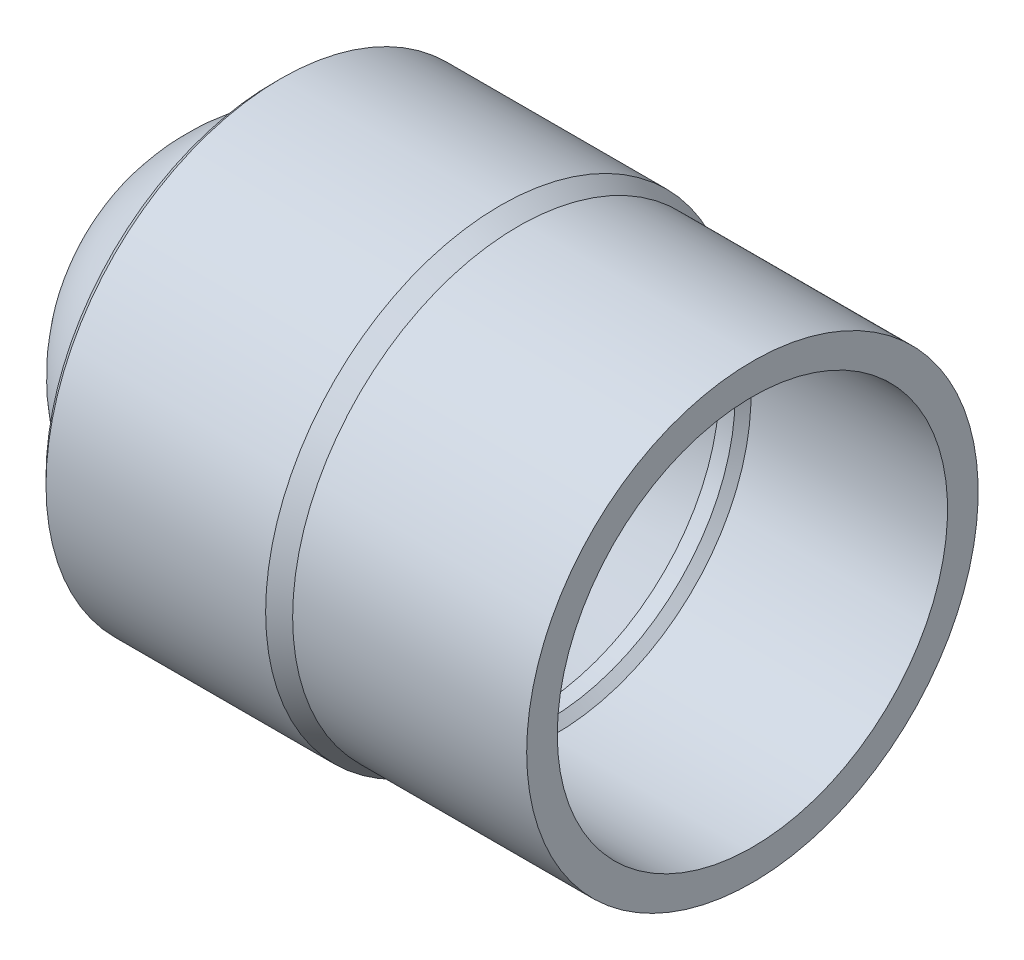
from build123d import *


with BuildPart() as part:
    # Sketch1 → Revolve1 (revolve)
    with BuildSketch(Plane(origin=(0, 0, 0), x_dir=(1, 0, 0), z_dir=(0, 1, 0)), mode=Mode.PRIVATE) as revolve1_sk:
        with BuildLine():
            Line((-19.05, 80.264), (-16.51, 82.804))
            Line((-16.51, 82.804), (60.96, 82.804))
            Line((60.96, 82.804), (67.31, 79.629))
            Line((67.31, 79.629), (149.86, 79.629))
            Line((149.86, 79.629), (149.86, 68.834))
            Line((149.86, 68.834), (80.518, 68.834))
            Line((80.518, 68.834), (77.724, 66.04))
            Line((77.724, 66.04), (72.1487, 66.04))
            Line((72.1487, 66.04), (54.61, 57.404))
            Line((54.61, 57.404), (0, 57.404))
            ThreePointArc((0, 57.404), (-40.590757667, 40.590757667), (-57.404, 0))
            Line((-57.404, 0), (-70.104, 0))
            ThreePointArc((-70.104, 0), (-49.571013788, 49.571013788), (0, 70.104))
            Line((0, 70.104), (-19.05, 70.104))
            Line((-19.05, 70.104), (-19.05, 80.264))
        make_face()
    revolve(revolve1_sk.sketch.rotate(Axis((0, 0, 0), (1, 0, 0)), 180), axis=Axis((0, 0, 0), (1, 0, 0)))


solid = part.part
